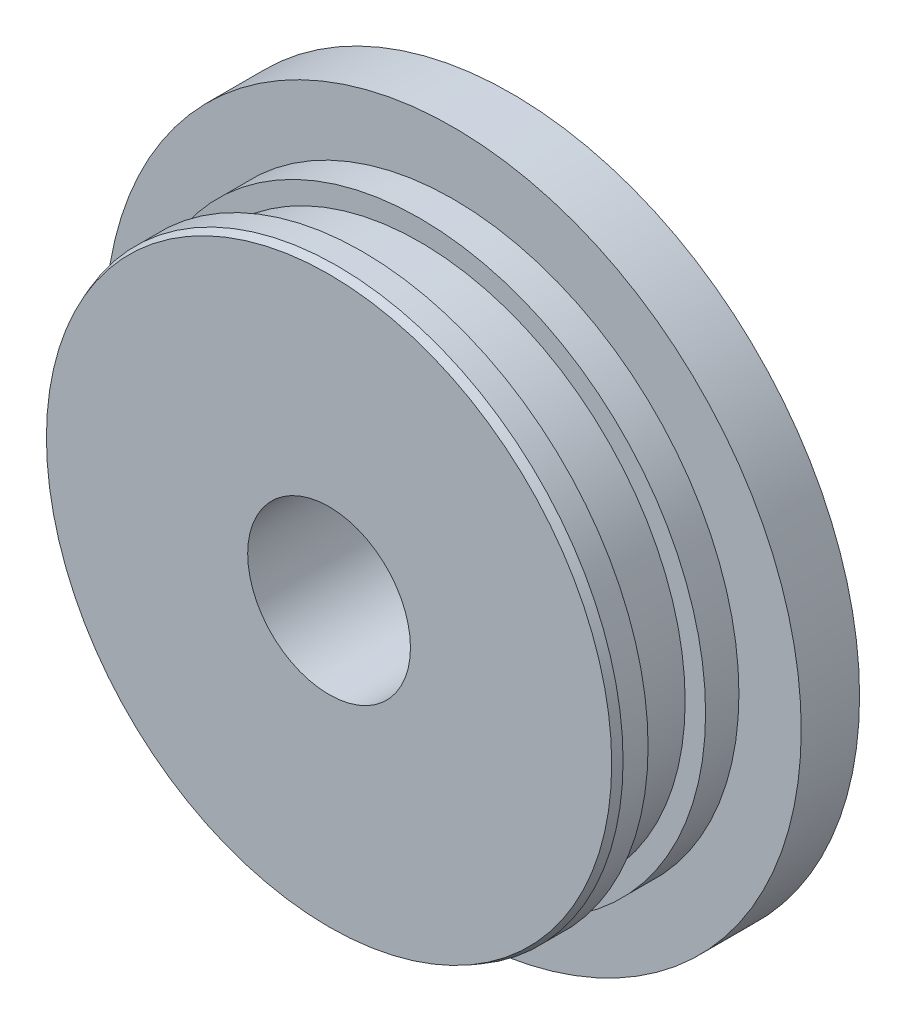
ISO-10303-21;
HEADER;
FILE_DESCRIPTION(('STEP AP214'),'2;1');
FILE_NAME('part.step','',(''),(''),'','','');
FILE_SCHEMA(('AUTOMOTIVE_DESIGN { 1 0 10303 214 1 1 1 1 }'));
ENDSEC;
DATA;
#1=APPLICATION_CONTEXT('core data for automotive mechanical design processes');
#2=APPLICATION_PROTOCOL_DEFINITION('international standard','automotive_design',2000,#1);
#3=PRODUCT_CONTEXT('',#1,'mechanical');
#4=PRODUCT('Part','Part','',(#3));
#5=PRODUCT_RELATED_PRODUCT_CATEGORY('part','',(#4));
#6=PRODUCT_DEFINITION_FORMATION('','',#4);
#7=PRODUCT_DEFINITION_CONTEXT('part definition',#1,'design');
#8=PRODUCT_DEFINITION('design','',#6,#7);
#9=PRODUCT_DEFINITION_SHAPE('','',#8);
#10=(LENGTH_UNIT() NAMED_UNIT(*) SI_UNIT(.MILLI.,.METRE.));
#11=(NAMED_UNIT(*) PLANE_ANGLE_UNIT() SI_UNIT($,.RADIAN.));
#12=(NAMED_UNIT(*) SI_UNIT($,.STERADIAN.) SOLID_ANGLE_UNIT());
#13=UNCERTAINTY_MEASURE_WITH_UNIT(LENGTH_MEASURE(1.E-05),#10,'distance_accuracy_value','');
#14=(GEOMETRIC_REPRESENTATION_CONTEXT(3) GLOBAL_UNCERTAINTY_ASSIGNED_CONTEXT((#13)) GLOBAL_UNIT_ASSIGNED_CONTEXT((#10,
#11,#12)) REPRESENTATION_CONTEXT('',''));
#15=CARTESIAN_POINT('',(0.,0.,0.));
#16=DIRECTION('',(0.,0.,1.));
#17=DIRECTION('',(1.,0.,0.));
#18=AXIS2_PLACEMENT_3D('',#15,#16,#17);
#19=CARTESIAN_POINT('',(0.,0.,25.4));
#20=DIRECTION('',(0.,0.,-1.));
#21=DIRECTION('',(-1.,0.,0.));
#22=AXIS2_PLACEMENT_3D('',#19,#20,#21);
#23=CYLINDRICAL_SURFACE('',#22,4.96062);
#24=CARTESIAN_POINT('',(0.,0.,3.13517889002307));
#25=DIRECTION('',(0.,0.,-1.));
#26=DIRECTION('',(-1.,0.,0.));
#27=AXIS2_PLACEMENT_3D('',#24,#25,#26);
#28=CIRCLE('',#27,4.96062);
#29=CARTESIAN_POINT('',(-4.96062,0.,3.13517889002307));
#30=VERTEX_POINT('',#29);
#31=EDGE_CURVE('E78',#30,#30,#28,.T.);
#32=ORIENTED_EDGE('',*,*,#31,.T.);
#33=EDGE_LOOP('',(#32));
#34=FACE_BOUND('',#33,.T.);
#35=CARTESIAN_POINT('',(0.,0.,11.1252));
#36=DIRECTION('',(0.,0.,1.));
#37=DIRECTION('',(1.,0.,0.));
#38=AXIS2_PLACEMENT_3D('',#35,#36,#37);
#39=CIRCLE('',#38,4.96062);
#40=CARTESIAN_POINT('',(4.96062,0.,11.1252));
#41=VERTEX_POINT('',#40);
#42=EDGE_CURVE('E38',#41,#41,#39,.T.);
#43=ORIENTED_EDGE('',*,*,#42,.T.);
#44=EDGE_LOOP('',(#43));
#45=FACE_BOUND('',#44,.T.);
#46=ADVANCED_FACE('F34',(#34,#45),#23,.F.);
#47=CARTESIAN_POINT('',(0.,0.,5.588));
#48=DIRECTION('',(0.,0.,1.));
#49=DIRECTION('',(1.,0.,0.));
#50=AXIS2_PLACEMENT_3D('',#47,#48,#49);
#51=PLANE('',#50);
#52=CARTESIAN_POINT('',(0.,0.,5.588));
#53=DIRECTION('',(0.,0.,1.));
#54=DIRECTION('',(1.,0.,0.));
#55=AXIS2_PLACEMENT_3D('',#52,#53,#54);
#56=CIRCLE('',#55,17.4117);
#57=CARTESIAN_POINT('',(17.4117,0.,5.588));
#58=VERTEX_POINT('',#57);
#59=EDGE_CURVE('E54',#58,#58,#56,.T.);
#60=ORIENTED_EDGE('',*,*,#59,.T.);
#61=EDGE_LOOP('',(#60));
#62=FACE_BOUND('',#61,.T.);
#63=CARTESIAN_POINT('',(0.,0.,5.588));
#64=DIRECTION('',(0.,0.,1.));
#65=DIRECTION('',(1.,0.,0.));
#66=AXIS2_PLACEMENT_3D('',#63,#64,#65);
#67=CIRCLE('',#66,16.1671);
#68=CARTESIAN_POINT('',(16.1671,0.,5.588));
#69=VERTEX_POINT('',#68);
#70=EDGE_CURVE('E63',#69,#69,#67,.T.);
#71=ORIENTED_EDGE('',*,*,#70,.F.);
#72=EDGE_LOOP('',(#71));
#73=FACE_BOUND('',#72,.T.);
#74=ADVANCED_FACE('F120',(#62,#73),#51,.T.);
#75=CARTESIAN_POINT('',(0.,0.,3.556));
#76=DIRECTION('',(0.,0.,1.));
#77=DIRECTION('',(1.,0.,0.));
#78=AXIS2_PLACEMENT_3D('',#75,#76,#77);
#79=PLANE('',#78);
#80=CARTESIAN_POINT('',(0.,0.,3.556));
#81=DIRECTION('',(0.,0.,1.));
#82=DIRECTION('',(1.,0.,0.));
#83=AXIS2_PLACEMENT_3D('',#80,#81,#82);
#84=CIRCLE('',#83,21.209);
#85=CARTESIAN_POINT('',(21.209,0.,3.556));
#86=VERTEX_POINT('',#85);
#87=EDGE_CURVE('E51',#86,#86,#84,.T.);
#88=ORIENTED_EDGE('',*,*,#87,.T.);
#89=EDGE_LOOP('',(#88));
#90=FACE_BOUND('',#89,.T.);
#91=CARTESIAN_POINT('',(0.,0.,3.556));
#92=DIRECTION('',(0.,0.,1.));
#93=DIRECTION('',(1.,0.,0.));
#94=AXIS2_PLACEMENT_3D('',#91,#92,#93);
#95=CIRCLE('',#94,17.4117);
#96=CARTESIAN_POINT('',(17.4117,0.,3.556));
#97=VERTEX_POINT('',#96);
#98=EDGE_CURVE('E57',#97,#97,#95,.T.);
#99=ORIENTED_EDGE('',*,*,#98,.F.);
#100=EDGE_LOOP('',(#99));
#101=FACE_BOUND('',#100,.T.);
#102=ADVANCED_FACE('F115',(#90,#101),#79,.T.);
#103=CARTESIAN_POINT('',(0.,0.,1.27));
#104=DIRECTION('',(0.,0.,-1.));
#105=DIRECTION('',(-1.,0.,0.));
#106=AXIS2_PLACEMENT_3D('',#103,#104,#105);
#107=CYLINDRICAL_SURFACE('',#106,21.209);
#108=CARTESIAN_POINT('',(0.,0.,0.));
#109=DIRECTION('',(0.,0.,1.));
#110=DIRECTION('',(1.,0.,0.));
#111=AXIS2_PLACEMENT_3D('',#108,#109,#110);
#112=CIRCLE('',#111,21.209);
#113=CARTESIAN_POINT('',(21.209,0.,0.));
#114=VERTEX_POINT('',#113);
#115=EDGE_CURVE('E46',#114,#114,#112,.T.);
#116=ORIENTED_EDGE('',*,*,#115,.T.);
#117=EDGE_LOOP('',(#116));
#118=FACE_BOUND('',#117,.T.);
#119=ORIENTED_EDGE('',*,*,#87,.F.);
#120=EDGE_LOOP('',(#119));
#121=FACE_BOUND('',#120,.T.);
#122=ADVANCED_FACE('F36',(#118,#121),#107,.T.);
#123=CARTESIAN_POINT('',(0.,0.,0.));
#124=DIRECTION('',(0.,0.,1.));
#125=DIRECTION('',(1.,0.,0.));
#126=AXIS2_PLACEMENT_3D('',#123,#124,#125);
#127=PLANE('',#126);
#128=CARTESIAN_POINT('',(0.,0.,0.));
#129=DIRECTION('',(0.,0.,-1.));
#130=DIRECTION('',(-1.,0.,0.));
#131=AXIS2_PLACEMENT_3D('',#128,#129,#130);
#132=CIRCLE('',#131,10.5156);
#133=CARTESIAN_POINT('',(-10.5156,0.,0.));
#134=VERTEX_POINT('',#133);
#135=EDGE_CURVE('E72',#134,#134,#132,.T.);
#136=ORIENTED_EDGE('',*,*,#135,.F.);
#137=EDGE_LOOP('',(#136));
#138=FACE_BOUND('',#137,.T.);
#139=ORIENTED_EDGE('',*,*,#115,.F.);
#140=EDGE_LOOP('',(#139));
#141=FACE_BOUND('',#140,.T.);
#142=ADVANCED_FACE('F107',(#138,#141),#127,.F.);
#143=CARTESIAN_POINT('',(0.,0.,5.588));
#144=DIRECTION('',(0.,0.,-1.));
#145=DIRECTION('',(-1.,0.,0.));
#146=AXIS2_PLACEMENT_3D('',#143,#144,#145);
#147=CYLINDRICAL_SURFACE('',#146,17.4117);
#148=ORIENTED_EDGE('',*,*,#59,.F.);
#149=EDGE_LOOP('',(#148));
#150=FACE_BOUND('',#149,.T.);
#151=ORIENTED_EDGE('',*,*,#98,.T.);
#152=EDGE_LOOP('',(#151));
#153=FACE_BOUND('',#152,.T.);
#154=ADVANCED_FACE('F110',(#150,#153),#147,.T.);
#155=CARTESIAN_POINT('',(0.,0.,9.0932));
#156=DIRECTION('',(0.,0.,-1.));
#157=DIRECTION('',(-1.,0.,0.));
#158=AXIS2_PLACEMENT_3D('',#155,#156,#157);
#159=CYLINDRICAL_SURFACE('',#158,16.1671);
#160=CARTESIAN_POINT('',(0.,0.,9.0932));
#161=DIRECTION('',(0.,0.,1.));
#162=DIRECTION('',(1.,0.,0.));
#163=AXIS2_PLACEMENT_3D('',#160,#161,#162);
#164=CIRCLE('',#163,16.1671);
#165=CARTESIAN_POINT('',(16.1671,0.,9.0932));
#166=VERTEX_POINT('',#165);
#167=EDGE_CURVE('E60',#166,#166,#164,.T.);
#168=ORIENTED_EDGE('',*,*,#167,.F.);
#169=EDGE_LOOP('',(#168));
#170=FACE_BOUND('',#169,.T.);
#171=ORIENTED_EDGE('',*,*,#70,.T.);
#172=EDGE_LOOP('',(#171));
#173=FACE_BOUND('',#172,.T.);
#174=ADVANCED_FACE('F125',(#170,#173),#159,.T.);
#175=CARTESIAN_POINT('',(0.,0.,9.0932));
#176=DIRECTION('',(0.,0.,1.));
#177=DIRECTION('',(1.,0.,0.));
#178=AXIS2_PLACEMENT_3D('',#175,#176,#177);
#179=PLANE('',#178);
#180=CARTESIAN_POINT('',(0.,0.,9.0932));
#181=DIRECTION('',(0.,0.,1.));
#182=DIRECTION('',(1.,0.,0.));
#183=AXIS2_PLACEMENT_3D('',#180,#181,#182);
#184=CIRCLE('',#183,17.4117);
#185=CARTESIAN_POINT('',(17.4117,0.,9.0932));
#186=VERTEX_POINT('',#185);
#187=EDGE_CURVE('E66',#186,#186,#184,.T.);
#188=ORIENTED_EDGE('',*,*,#187,.F.);
#189=EDGE_LOOP('',(#188));
#190=FACE_BOUND('',#189,.T.);
#191=ORIENTED_EDGE('',*,*,#167,.T.);
#192=EDGE_LOOP('',(#191));
#193=FACE_BOUND('',#192,.T.);
#194=ADVANCED_FACE('F131',(#190,#193),#179,.F.);
#195=CARTESIAN_POINT('',(0.,0.,11.1252));
#196=DIRECTION('',(0.,0.,-1.));
#197=DIRECTION('',(-1.,0.,0.));
#198=AXIS2_PLACEMENT_3D('',#195,#196,#197);
#199=CYLINDRICAL_SURFACE('',#198,17.4117);
#200=CARTESIAN_POINT('',(0.,0.,10.6172));
#201=DIRECTION('',(0.,0.,1.));
#202=DIRECTION('',(1.,0.,0.));
#203=AXIS2_PLACEMENT_3D('',#200,#201,#202);
#204=CIRCLE('',#203,17.4117);
#205=CARTESIAN_POINT('',(17.4117,0.,10.6172));
#206=VERTEX_POINT('',#205);
#207=EDGE_CURVE('E10',#206,#206,#204,.F.);
#208=ORIENTED_EDGE('',*,*,#207,.T.);
#209=EDGE_LOOP('',(#208));
#210=FACE_BOUND('',#209,.T.);
#211=ORIENTED_EDGE('',*,*,#187,.T.);
#212=EDGE_LOOP('',(#211));
#213=FACE_BOUND('',#212,.T.);
#214=ADVANCED_FACE('F151',(#210,#213),#199,.T.);
#215=CARTESIAN_POINT('',(0.,0.,11.1252));
#216=DIRECTION('',(0.,0.,1.));
#217=DIRECTION('',(1.,0.,0.));
#218=AXIS2_PLACEMENT_3D('',#215,#216,#217);
#219=PLANE('',#218);
#220=ORIENTED_EDGE('',*,*,#42,.F.);
#221=EDGE_LOOP('',(#220));
#222=FACE_BOUND('',#221,.T.);
#223=CARTESIAN_POINT('',(0.,0.,11.1252));
#224=DIRECTION('',(0.,0.,1.));
#225=DIRECTION('',(1.,0.,0.));
#226=AXIS2_PLACEMENT_3D('',#223,#224,#225);
#227=CIRCLE('',#226,17.2268031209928);
#228=CARTESIAN_POINT('',(17.2268031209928,0.,11.1252));
#229=VERTEX_POINT('',#228);
#230=EDGE_CURVE('E42',#229,#229,#227,.T.);
#231=ORIENTED_EDGE('',*,*,#230,.T.);
#232=EDGE_LOOP('',(#231));
#233=FACE_BOUND('',#232,.T.);
#234=ADVANCED_FACE('F147',(#222,#233),#219,.T.);
#235=CARTESIAN_POINT('',(0.,0.,11.1252));
#236=DIRECTION('',(0.,0.,-1.));
#237=DIRECTION('',(-1.,0.,0.));
#238=AXIS2_PLACEMENT_3D('',#235,#236,#237);
#239=CONICAL_SURFACE('',#238,17.2268031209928,0.349065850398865);
#240=ORIENTED_EDGE('',*,*,#207,.F.);
#241=EDGE_LOOP('',(#240));
#242=FACE_BOUND('',#241,.T.);
#243=ORIENTED_EDGE('',*,*,#230,.F.);
#244=EDGE_LOOP('',(#243));
#245=FACE_BOUND('',#244,.T.);
#246=ADVANCED_FACE('F98',(#242,#245),#239,.T.);
#247=CARTESIAN_POINT('',(0.,0.,0.0508));
#248=DIRECTION('',(0.,0.,-1.));
#249=DIRECTION('',(-1.,0.,0.));
#250=AXIS2_PLACEMENT_3D('',#247,#248,#249);
#251=PLANE('',#250);
#252=CARTESIAN_POINT('',(0.,0.,0.0508));
#253=DIRECTION('',(0.,0.,-1.));
#254=DIRECTION('',(-1.,0.,0.));
#255=AXIS2_PLACEMENT_3D('',#252,#253,#254);
#256=CIRCLE('',#255,6.1849);
#257=CARTESIAN_POINT('',(-6.1849,0.,0.0508));
#258=VERTEX_POINT('',#257);
#259=EDGE_CURVE('E75',#258,#258,#256,.T.);
#260=ORIENTED_EDGE('',*,*,#259,.F.);
#261=EDGE_LOOP('',(#260));
#262=FACE_BOUND('',#261,.T.);
#263=CARTESIAN_POINT('',(0.,0.,0.0508));
#264=DIRECTION('',(0.,0.,-1.));
#265=DIRECTION('',(-1.,0.,0.));
#266=AXIS2_PLACEMENT_3D('',#263,#264,#265);
#267=CIRCLE('',#266,10.5156);
#268=CARTESIAN_POINT('',(-10.5156,0.,0.0508));
#269=VERTEX_POINT('',#268);
#270=EDGE_CURVE('E69',#269,#269,#267,.T.);
#271=ORIENTED_EDGE('',*,*,#270,.T.);
#272=EDGE_LOOP('',(#271));
#273=FACE_BOUND('',#272,.T.);
#274=ADVANCED_FACE('F95',(#262,#273),#251,.T.);
#275=CARTESIAN_POINT('',(0.,0.,0.0508));
#276=DIRECTION('',(0.,0.,-1.));
#277=DIRECTION('',(-1.,0.,0.));
#278=AXIS2_PLACEMENT_3D('',#275,#276,#277);
#279=CYLINDRICAL_SURFACE('',#278,10.5156);
#280=ORIENTED_EDGE('',*,*,#270,.F.);
#281=EDGE_LOOP('',(#280));
#282=FACE_BOUND('',#281,.T.);
#283=ORIENTED_EDGE('',*,*,#135,.T.);
#284=EDGE_LOOP('',(#283));
#285=FACE_BOUND('',#284,.T.);
#286=ADVANCED_FACE('F91',(#282,#285),#279,.F.);
#287=CARTESIAN_POINT('',(0.,0.,0.0508));
#288=DIRECTION('',(0.,0.,-1.));
#289=DIRECTION('',(-1.,0.,0.));
#290=AXIS2_PLACEMENT_3D('',#287,#288,#289);
#291=CONICAL_SURFACE('',#290,6.1849,0.20943951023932);
#292=CARTESIAN_POINT('',(0.,0.,2.413));
#293=DIRECTION('',(0.,0.,-1.));
#294=DIRECTION('',(-1.,0.,0.));
#295=AXIS2_PLACEMENT_3D('',#292,#293,#294);
#296=CIRCLE('',#295,5.68279889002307);
#297=CARTESIAN_POINT('',(-5.68279889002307,0.,2.413));
#298=VERTEX_POINT('',#297);
#299=EDGE_CURVE('E81',#298,#298,#296,.T.);
#300=ORIENTED_EDGE('',*,*,#299,.F.);
#301=EDGE_LOOP('',(#300));
#302=FACE_BOUND('',#301,.T.);
#303=ORIENTED_EDGE('',*,*,#259,.T.);
#304=EDGE_LOOP('',(#303));
#305=FACE_BOUND('',#304,.T.);
#306=ADVANCED_FACE('F88',(#302,#305),#291,.F.);
#307=CARTESIAN_POINT('',(0.,0.,2.413));
#308=DIRECTION('',(0.,0.,-1.));
#309=DIRECTION('',(-1.,0.,0.));
#310=AXIS2_PLACEMENT_3D('',#307,#308,#309);
#311=CONICAL_SURFACE('',#310,5.68279889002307,0.78539816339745);
#312=ORIENTED_EDGE('',*,*,#299,.T.);
#313=EDGE_LOOP('',(#312));
#314=FACE_BOUND('',#313,.T.);
#315=ORIENTED_EDGE('',*,*,#31,.F.);
#316=EDGE_LOOP('',(#315));
#317=FACE_BOUND('',#316,.T.);
#318=ADVANCED_FACE('F85',(#314,#317),#311,.F.);
#319=CLOSED_SHELL('',(#46,#74,#102,#122,#142,#154,#174,#194,#214,#234,#246,#274,#286,#306,#318));
#320=MANIFOLD_SOLID_BREP('B2',#319);
#321=ADVANCED_BREP_SHAPE_REPRESENTATION('',(#18,#320),#14);
#322=SHAPE_DEFINITION_REPRESENTATION(#9,#321);
ENDSEC;
END-ISO-10303-21;
